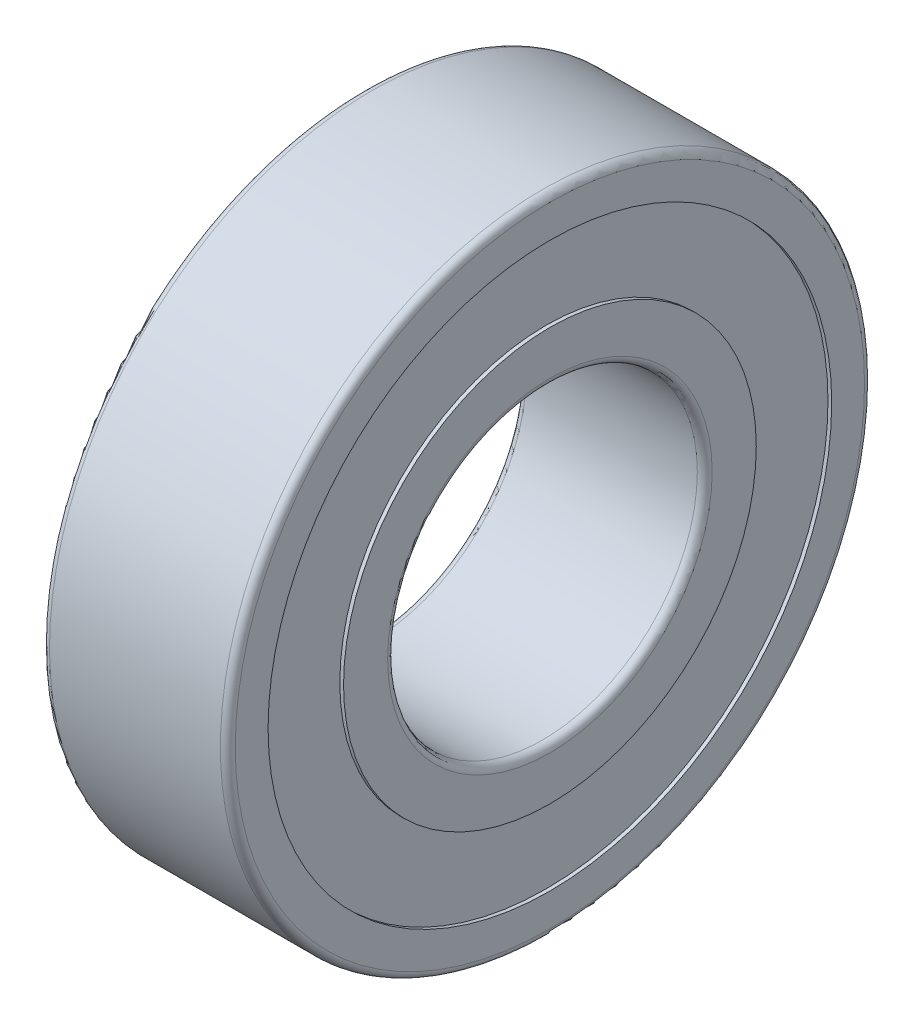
ISO-10303-21;
HEADER;
FILE_DESCRIPTION(('STEP AP214'),'2;1');
FILE_NAME('part.step','',(''),(''),'','','');
FILE_SCHEMA(('AUTOMOTIVE_DESIGN { 1 0 10303 214 1 1 1 1 }'));
ENDSEC;
DATA;
#1=APPLICATION_CONTEXT('core data for automotive mechanical design processes');
#2=APPLICATION_PROTOCOL_DEFINITION('international standard','automotive_design',2000,#1);
#3=PRODUCT_CONTEXT('',#1,'mechanical');
#4=PRODUCT('Part','Part','',(#3));
#5=PRODUCT_RELATED_PRODUCT_CATEGORY('part','',(#4));
#6=PRODUCT_DEFINITION_FORMATION('','',#4);
#7=PRODUCT_DEFINITION_CONTEXT('part definition',#1,'design');
#8=PRODUCT_DEFINITION('design','',#6,#7);
#9=PRODUCT_DEFINITION_SHAPE('','',#8);
#10=(LENGTH_UNIT() NAMED_UNIT(*) SI_UNIT(.MILLI.,.METRE.));
#11=(NAMED_UNIT(*) PLANE_ANGLE_UNIT() SI_UNIT($,.RADIAN.));
#12=(NAMED_UNIT(*) SI_UNIT($,.STERADIAN.) SOLID_ANGLE_UNIT());
#13=UNCERTAINTY_MEASURE_WITH_UNIT(LENGTH_MEASURE(1.E-05),#10,'distance_accuracy_value','');
#14=(GEOMETRIC_REPRESENTATION_CONTEXT(3) GLOBAL_UNCERTAINTY_ASSIGNED_CONTEXT((#13)) GLOBAL_UNIT_ASSIGNED_CONTEXT((#10,
#11,#12)) REPRESENTATION_CONTEXT('',''));
#15=CARTESIAN_POINT('',(0.,0.,0.));
#16=DIRECTION('',(0.,0.,1.));
#17=DIRECTION('',(1.,0.,0.));
#18=AXIS2_PLACEMENT_3D('',#15,#16,#17);
#19=CARTESIAN_POINT('',(-7.5,0.,-12.5));
#20=DIRECTION('',(-1.,0.,0.));
#21=DIRECTION('',(0.,0.,1.));
#22=AXIS2_PLACEMENT_3D('',#19,#20,#21);
#23=PLANE('',#22);
#24=CARTESIAN_POINT('',(-7.5,0.,0.));
#25=DIRECTION('',(-1.,0.,0.));
#26=DIRECTION('',(0.,0.,1.));
#27=AXIS2_PLACEMENT_3D('',#24,#25,#26);
#28=CIRCLE('',#27,25.4);
#29=CARTESIAN_POINT('',(-7.5,0.,25.4));
#30=VERTEX_POINT('',#29);
#31=EDGE_CURVE('E37',#30,#30,#28,.T.);
#32=ORIENTED_EDGE('',*,*,#31,.T.);
#33=EDGE_LOOP('',(#32));
#34=FACE_BOUND('',#33,.T.);
#35=CARTESIAN_POINT('',(-7.5,0.,0.));
#36=DIRECTION('',(1.,0.,0.));
#37=DIRECTION('',(0.,0.,-1.));
#38=AXIS2_PLACEMENT_3D('',#35,#36,#37);
#39=CIRCLE('',#38,22.75);
#40=CARTESIAN_POINT('',(-7.5,0.,-22.75));
#41=VERTEX_POINT('',#40);
#42=EDGE_CURVE('E77',#41,#41,#39,.T.);
#43=ORIENTED_EDGE('',*,*,#42,.T.);
#44=EDGE_LOOP('',(#43));
#45=FACE_BOUND('',#44,.T.);
#46=ADVANCED_FACE('F30',(#34,#45),#23,.T.);
#47=CARTESIAN_POINT('',(7.5,0.,-12.5));
#48=DIRECTION('',(1.,0.,0.));
#49=DIRECTION('',(0.,0.,-1.));
#50=AXIS2_PLACEMENT_3D('',#47,#48,#49);
#51=PLANE('',#50);
#52=CARTESIAN_POINT('',(7.5,0.,0.));
#53=DIRECTION('',(1.,0.,0.));
#54=DIRECTION('',(0.,0.,-1.));
#55=AXIS2_PLACEMENT_3D('',#52,#53,#54);
#56=CIRCLE('',#55,13.1);
#57=CARTESIAN_POINT('',(7.5,0.,-13.1));
#58=VERTEX_POINT('',#57);
#59=EDGE_CURVE('E50',#58,#58,#56,.F.);
#60=ORIENTED_EDGE('',*,*,#59,.T.);
#61=EDGE_LOOP('',(#60));
#62=FACE_BOUND('',#61,.T.);
#63=CARTESIAN_POINT('',(7.5,0.,0.));
#64=DIRECTION('',(1.,0.,0.));
#65=DIRECTION('',(0.,0.,-1.));
#66=AXIS2_PLACEMENT_3D('',#63,#64,#65);
#67=CIRCLE('',#66,16.66);
#68=CARTESIAN_POINT('',(7.5,0.,-16.66));
#69=VERTEX_POINT('',#68);
#70=EDGE_CURVE('E71',#69,#69,#67,.T.);
#71=ORIENTED_EDGE('',*,*,#70,.T.);
#72=EDGE_LOOP('',(#71));
#73=FACE_BOUND('',#72,.T.);
#74=ADVANCED_FACE('F105',(#62,#73),#51,.T.);
#75=CARTESIAN_POINT('',(0.,0.,0.));
#76=DIRECTION('',(1.,0.,0.));
#77=DIRECTION('',(0.,0.,-1.));
#78=AXIS2_PLACEMENT_3D('',#75,#76,#77);
#79=CYLINDRICAL_SURFACE('',#78,26.);
#80=CARTESIAN_POINT('',(-6.9,0.,0.));
#81=DIRECTION('',(-1.,0.,0.));
#82=DIRECTION('',(0.,0.,1.));
#83=AXIS2_PLACEMENT_3D('',#80,#81,#82);
#84=CIRCLE('',#83,26.);
#85=CARTESIAN_POINT('',(-6.9,0.,26.));
#86=VERTEX_POINT('',#85);
#87=EDGE_CURVE('E41',#86,#86,#84,.F.);
#88=ORIENTED_EDGE('',*,*,#87,.T.);
#89=EDGE_LOOP('',(#88));
#90=FACE_BOUND('',#89,.T.);
#91=CARTESIAN_POINT('',(6.9,0.,0.));
#92=DIRECTION('',(1.,0.,0.));
#93=DIRECTION('',(0.,0.,-1.));
#94=AXIS2_PLACEMENT_3D('',#91,#92,#93);
#95=CIRCLE('',#94,26.);
#96=CARTESIAN_POINT('',(6.9,0.,-26.));
#97=VERTEX_POINT('',#96);
#98=EDGE_CURVE('E45',#97,#97,#95,.F.);
#99=ORIENTED_EDGE('',*,*,#98,.T.);
#100=EDGE_LOOP('',(#99));
#101=FACE_BOUND('',#100,.T.);
#102=ADVANCED_FACE('F32',(#90,#101),#79,.T.);
#103=CARTESIAN_POINT('',(7.5,0.,0.));
#104=DIRECTION('',(1.,0.,0.));
#105=DIRECTION('',(0.,0.,-1.));
#106=AXIS2_PLACEMENT_3D('',#103,#104,#105);
#107=CIRCLE('',#106,25.4);
#108=CARTESIAN_POINT('',(7.5,0.,-25.4));
#109=VERTEX_POINT('',#108);
#110=EDGE_CURVE('E10',#109,#109,#107,.T.);
#111=ORIENTED_EDGE('',*,*,#110,.T.);
#112=EDGE_LOOP('',(#111));
#113=FACE_BOUND('',#112,.T.);
#114=CARTESIAN_POINT('',(7.5,0.,0.));
#115=DIRECTION('',(1.,0.,0.));
#116=DIRECTION('',(0.,0.,-1.));
#117=AXIS2_PLACEMENT_3D('',#114,#115,#116);
#118=CIRCLE('',#117,22.75);
#119=CARTESIAN_POINT('',(7.5,0.,-22.75));
#120=VERTEX_POINT('',#119);
#121=EDGE_CURVE('E65',#120,#120,#118,.T.);
#122=ORIENTED_EDGE('',*,*,#121,.F.);
#123=EDGE_LOOP('',(#122));
#124=FACE_BOUND('',#123,.T.);
#125=ADVANCED_FACE('F101',(#113,#124),#51,.T.);
#126=CARTESIAN_POINT('',(0.,0.,0.));
#127=DIRECTION('',(1.,0.,0.));
#128=DIRECTION('',(0.,0.,-1.));
#129=AXIS2_PLACEMENT_3D('',#126,#127,#128);
#130=CYLINDRICAL_SURFACE('',#129,12.5);
#131=CARTESIAN_POINT('',(-6.9,0.,0.));
#132=DIRECTION('',(-1.,0.,0.));
#133=DIRECTION('',(0.,0.,1.));
#134=AXIS2_PLACEMENT_3D('',#131,#132,#133);
#135=CIRCLE('',#134,12.5);
#136=CARTESIAN_POINT('',(-6.9,0.,12.5));
#137=VERTEX_POINT('',#136);
#138=EDGE_CURVE('E53',#137,#137,#135,.T.);
#139=ORIENTED_EDGE('',*,*,#138,.T.);
#140=EDGE_LOOP('',(#139));
#141=FACE_BOUND('',#140,.T.);
#142=CARTESIAN_POINT('',(6.9,0.,0.));
#143=DIRECTION('',(1.,0.,0.));
#144=DIRECTION('',(0.,0.,-1.));
#145=AXIS2_PLACEMENT_3D('',#142,#143,#144);
#146=CIRCLE('',#145,12.5);
#147=CARTESIAN_POINT('',(6.9,0.,-12.5));
#148=VERTEX_POINT('',#147);
#149=EDGE_CURVE('E56',#148,#148,#146,.T.);
#150=ORIENTED_EDGE('',*,*,#149,.T.);
#151=EDGE_LOOP('',(#150));
#152=FACE_BOUND('',#151,.T.);
#153=ADVANCED_FACE('F92',(#141,#152),#130,.F.);
#154=CARTESIAN_POINT('',(-7.5,0.,0.));
#155=DIRECTION('',(-1.,0.,0.));
#156=DIRECTION('',(0.,0.,1.));
#157=AXIS2_PLACEMENT_3D('',#154,#155,#156);
#158=CIRCLE('',#157,13.1);
#159=CARTESIAN_POINT('',(-7.5,0.,13.1));
#160=VERTEX_POINT('',#159);
#161=EDGE_CURVE('E59',#160,#160,#158,.F.);
#162=ORIENTED_EDGE('',*,*,#161,.T.);
#163=EDGE_LOOP('',(#162));
#164=FACE_BOUND('',#163,.T.);
#165=CARTESIAN_POINT('',(-7.5,0.,0.));
#166=DIRECTION('',(1.,0.,0.));
#167=DIRECTION('',(0.,0.,-1.));
#168=AXIS2_PLACEMENT_3D('',#165,#166,#167);
#169=CIRCLE('',#168,16.66);
#170=CARTESIAN_POINT('',(-7.5,0.,-16.66));
#171=VERTEX_POINT('',#170);
#172=EDGE_CURVE('E83',#171,#171,#169,.T.);
#173=ORIENTED_EDGE('',*,*,#172,.F.);
#174=EDGE_LOOP('',(#173));
#175=FACE_BOUND('',#174,.T.);
#176=ADVANCED_FACE('F89',(#164,#175),#23,.T.);
#177=CARTESIAN_POINT('',(7.2,0.,0.));
#178=DIRECTION('',(1.,0.,0.));
#179=DIRECTION('',(0.,0.,-1.));
#180=AXIS2_PLACEMENT_3D('',#177,#178,#179);
#181=CYLINDRICAL_SURFACE('',#180,22.75);
#182=CARTESIAN_POINT('',(7.2,0.,0.));
#183=DIRECTION('',(1.,0.,0.));
#184=DIRECTION('',(0.,0.,-1.));
#185=AXIS2_PLACEMENT_3D('',#182,#183,#184);
#186=CIRCLE('',#185,22.75);
#187=CARTESIAN_POINT('',(7.2,0.,-22.75));
#188=VERTEX_POINT('',#187);
#189=EDGE_CURVE('E62',#188,#188,#186,.T.);
#190=ORIENTED_EDGE('',*,*,#189,.F.);
#191=EDGE_LOOP('',(#190));
#192=FACE_BOUND('',#191,.T.);
#193=ORIENTED_EDGE('',*,*,#121,.T.);
#194=EDGE_LOOP('',(#193));
#195=FACE_BOUND('',#194,.T.);
#196=ADVANCED_FACE('F91',(#192,#195),#181,.F.);
#197=CARTESIAN_POINT('',(7.2,0.,0.));
#198=DIRECTION('',(1.,0.,0.));
#199=DIRECTION('',(0.,0.,-1.));
#200=AXIS2_PLACEMENT_3D('',#197,#198,#199);
#201=PLANE('',#200);
#202=CARTESIAN_POINT('',(7.2,0.,0.));
#203=DIRECTION('',(1.,0.,0.));
#204=DIRECTION('',(0.,0.,-1.));
#205=AXIS2_PLACEMENT_3D('',#202,#203,#204);
#206=CIRCLE('',#205,16.66);
#207=CARTESIAN_POINT('',(7.2,0.,-16.66));
#208=VERTEX_POINT('',#207);
#209=EDGE_CURVE('E68',#208,#208,#206,.T.);
#210=ORIENTED_EDGE('',*,*,#209,.F.);
#211=EDGE_LOOP('',(#210));
#212=FACE_BOUND('',#211,.T.);
#213=ORIENTED_EDGE('',*,*,#189,.T.);
#214=EDGE_LOOP('',(#213));
#215=FACE_BOUND('',#214,.T.);
#216=ADVANCED_FACE('F98',(#212,#215),#201,.T.);
#217=CARTESIAN_POINT('',(7.2,0.,0.));
#218=DIRECTION('',(1.,0.,0.));
#219=DIRECTION('',(0.,0.,-1.));
#220=AXIS2_PLACEMENT_3D('',#217,#218,#219);
#221=CYLINDRICAL_SURFACE('',#220,16.66);
#222=ORIENTED_EDGE('',*,*,#209,.T.);
#223=EDGE_LOOP('',(#222));
#224=FACE_BOUND('',#223,.T.);
#225=ORIENTED_EDGE('',*,*,#70,.F.);
#226=EDGE_LOOP('',(#225));
#227=FACE_BOUND('',#226,.T.);
#228=ADVANCED_FACE('F123',(#224,#227),#221,.T.);
#229=CARTESIAN_POINT('',(-7.2,0.,0.));
#230=DIRECTION('',(-1.,0.,0.));
#231=DIRECTION('',(0.,0.,-1.));
#232=AXIS2_PLACEMENT_3D('',#229,#230,#231);
#233=PLANE('',#232);
#234=CARTESIAN_POINT('',(-7.2,0.,0.));
#235=DIRECTION('',(1.,0.,0.));
#236=DIRECTION('',(0.,0.,-1.));
#237=AXIS2_PLACEMENT_3D('',#234,#235,#236);
#238=CIRCLE('',#237,22.75);
#239=CARTESIAN_POINT('',(-7.2,0.,-22.75));
#240=VERTEX_POINT('',#239);
#241=EDGE_CURVE('E74',#240,#240,#238,.T.);
#242=ORIENTED_EDGE('',*,*,#241,.F.);
#243=EDGE_LOOP('',(#242));
#244=FACE_BOUND('',#243,.T.);
#245=CARTESIAN_POINT('',(-7.2,0.,0.));
#246=DIRECTION('',(1.,0.,0.));
#247=DIRECTION('',(0.,0.,-1.));
#248=AXIS2_PLACEMENT_3D('',#245,#246,#247);
#249=CIRCLE('',#248,16.66);
#250=CARTESIAN_POINT('',(-7.2,0.,-16.66));
#251=VERTEX_POINT('',#250);
#252=EDGE_CURVE('E80',#251,#251,#249,.T.);
#253=ORIENTED_EDGE('',*,*,#252,.T.);
#254=EDGE_LOOP('',(#253));
#255=FACE_BOUND('',#254,.T.);
#256=ADVANCED_FACE('F114',(#244,#255),#233,.T.);
#257=CARTESIAN_POINT('',(-7.2,0.,0.));
#258=DIRECTION('',(-1.,0.,0.));
#259=DIRECTION('',(0.,0.,1.));
#260=AXIS2_PLACEMENT_3D('',#257,#258,#259);
#261=CYLINDRICAL_SURFACE('',#260,22.75);
#262=ORIENTED_EDGE('',*,*,#241,.T.);
#263=EDGE_LOOP('',(#262));
#264=FACE_BOUND('',#263,.T.);
#265=ORIENTED_EDGE('',*,*,#42,.F.);
#266=EDGE_LOOP('',(#265));
#267=FACE_BOUND('',#266,.T.);
#268=ADVANCED_FACE('F112',(#264,#267),#261,.F.);
#269=CARTESIAN_POINT('',(-7.2,0.,0.));
#270=DIRECTION('',(-1.,0.,0.));
#271=DIRECTION('',(0.,0.,1.));
#272=AXIS2_PLACEMENT_3D('',#269,#270,#271);
#273=CYLINDRICAL_SURFACE('',#272,16.66);
#274=ORIENTED_EDGE('',*,*,#252,.F.);
#275=EDGE_LOOP('',(#274));
#276=FACE_BOUND('',#275,.T.);
#277=ORIENTED_EDGE('',*,*,#172,.T.);
#278=EDGE_LOOP('',(#277));
#279=FACE_BOUND('',#278,.T.);
#280=ADVANCED_FACE('F87',(#276,#279),#273,.T.);
#281=CARTESIAN_POINT('',(-6.9,0.,0.));
#282=DIRECTION('',(-1.,0.,0.));
#283=DIRECTION('',(0.,0.,1.));
#284=AXIS2_PLACEMENT_3D('',#281,#282,#283);
#285=TOROIDAL_SURFACE('',#284,13.1,0.6);
#286=ORIENTED_EDGE('',*,*,#138,.F.);
#287=EDGE_LOOP('',(#286));
#288=FACE_BOUND('',#287,.T.);
#289=ORIENTED_EDGE('',*,*,#161,.F.);
#290=EDGE_LOOP('',(#289));
#291=FACE_BOUND('',#290,.T.);
#292=ADVANCED_FACE('F120',(#288,#291),#285,.T.);
#293=CARTESIAN_POINT('',(6.9,0.,0.));
#294=DIRECTION('',(1.,0.,0.));
#295=DIRECTION('',(0.,0.,-1.));
#296=AXIS2_PLACEMENT_3D('',#293,#294,#295);
#297=TOROIDAL_SURFACE('',#296,13.1,0.6);
#298=ORIENTED_EDGE('',*,*,#59,.F.);
#299=EDGE_LOOP('',(#298));
#300=FACE_BOUND('',#299,.T.);
#301=ORIENTED_EDGE('',*,*,#149,.F.);
#302=EDGE_LOOP('',(#301));
#303=FACE_BOUND('',#302,.T.);
#304=ADVANCED_FACE('F155',(#300,#303),#297,.T.);
#305=CARTESIAN_POINT('',(-6.9,0.,0.));
#306=DIRECTION('',(-1.,0.,0.));
#307=DIRECTION('',(0.,0.,1.));
#308=AXIS2_PLACEMENT_3D('',#305,#306,#307);
#309=TOROIDAL_SURFACE('',#308,25.4,0.6);
#310=ORIENTED_EDGE('',*,*,#31,.F.);
#311=EDGE_LOOP('',(#310));
#312=FACE_BOUND('',#311,.T.);
#313=ORIENTED_EDGE('',*,*,#87,.F.);
#314=EDGE_LOOP('',(#313));
#315=FACE_BOUND('',#314,.T.);
#316=ADVANCED_FACE('F151',(#312,#315),#309,.T.);
#317=CARTESIAN_POINT('',(6.9,0.,0.));
#318=DIRECTION('',(1.,0.,0.));
#319=DIRECTION('',(0.,0.,-1.));
#320=AXIS2_PLACEMENT_3D('',#317,#318,#319);
#321=TOROIDAL_SURFACE('',#320,25.4,0.6);
#322=ORIENTED_EDGE('',*,*,#98,.F.);
#323=EDGE_LOOP('',(#322));
#324=FACE_BOUND('',#323,.T.);
#325=ORIENTED_EDGE('',*,*,#110,.F.);
#326=EDGE_LOOP('',(#325));
#327=FACE_BOUND('',#326,.T.);
#328=ADVANCED_FACE('F148',(#324,#327),#321,.T.);
#329=CLOSED_SHELL('',(#46,#74,#102,#125,#153,#176,#196,#216,#228,#256,#268,#280,#292,#304,#316,#328));
#330=MANIFOLD_SOLID_BREP('B2',#329);
#331=ADVANCED_BREP_SHAPE_REPRESENTATION('',(#18,#330),#14);
#332=SHAPE_DEFINITION_REPRESENTATION(#9,#331);
ENDSEC;
END-ISO-10303-21;
